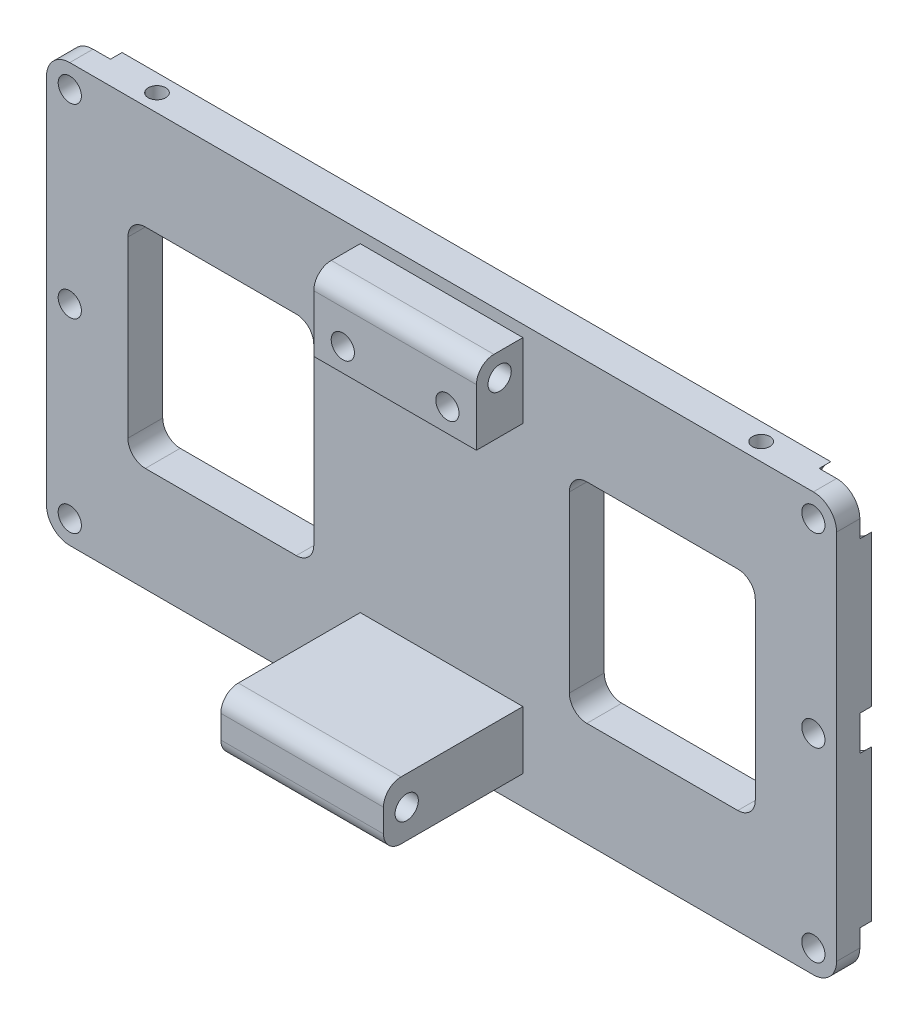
from build123d import *

# Parameters (mm, degrees)
SKETCH2_W               = 215.9
SKETCH2_H               = 114.3
SKETCH2_R               = 3.175
SKETCH2_W_2             = 50.8
SKETCH2_H_2             = 57.15
BOSS_EXTRUDE1_DEPTH     = 9.525
SKETCH4_W               = 44.45
SKETCH4_H               = 20.32
BOSS_EXTRUDE2_DEPTH     = 12.7
SKETCH6_R               = 3.175
CUT_EXTRUDE2_DEPTH      = 45.72
SKETCH7_R               = 3.175
CUT_EXTRUDE3_DEPTH      = 22.86
SKETCH8_W               = 44.45
SKETCH8_H               = 15.875
BOSS_EXTRUDE3_DEPTH     = 38.1
SKETCH9_R               = 3.175
CUT_EXTRUDE4_DEPTH      = 46.355
CUT_EXTRUDE5_DEPTH      = 15.875
CUT_EXTRUDE5_DEPTH_BACK = 12.7
SKETCH10_R              = 3.9624
FILLET1_R               = 6.35
FILLET2_R               = 4.7752
FILLET3_R               = 4.7752
CUT_EXTRUDE6_START      = -6.35
SKETCH11_R              = 7.9375
CUT_EXTRUDE6_DEPTH      = 10.16
FILLET4_R               = 4.7752
SKETCH12_R              = 2.3876
CUT_EXTRUDE7_DEPTH      = 14.224


with BuildPart() as part:
    # Sketch2 → Boss-Extrude1 (new body)
    with BuildSketch(Plane.XY):
        Rectangle(SKETCH2_W, SKETCH2_H)
        with Locations((-101.6, 50.8)):
            Circle(SKETCH2_R, mode=Mode.SUBTRACT)
        with Locations((-101.6, -50.8)):
            Circle(SKETCH2_R, mode=Mode.SUBTRACT)
        with Locations((101.6, -50.8)):
            Circle(SKETCH2_R, mode=Mode.SUBTRACT)
        with Locations((101.6, 50.8)):
            Circle(SKETCH2_R, mode=Mode.SUBTRACT)
        with Locations((101.6, 0)):
            Circle(SKETCH2_R, mode=Mode.SUBTRACT)
        with Locations((-101.6, 0)):
            Circle(SKETCH2_R, mode=Mode.SUBTRACT)
        with Locations((-60.325, 0)):
            Rectangle(SKETCH2_W_2, SKETCH2_H_2, mode=Mode.SUBTRACT)
        with Locations((60.325, 0)):
            Rectangle(SKETCH2_W_2, SKETCH2_H_2, mode=Mode.SUBTRACT)
    extrude(amount=-BOSS_EXTRUDE1_DEPTH)


with BuildPart() as body_2:
    # Sketch4 → Boss-Extrude2 (new body)
    with BuildSketch(Plane.XY):
        with Locations((0, 43.815)):
            Rectangle(SKETCH4_W, SKETCH4_H)
    extrude(amount=BOSS_EXTRUDE2_DEPTH)

    # Sketch6 → Cut-Extrude2 (cut)
    with BuildSketch(Plane.ZY.offset(22.225)):
        with Locations(Location((6.35, 47.625, 0), (0, 0, 270))):
            Circle(SKETCH6_R)
    extrude(amount=-CUT_EXTRUDE2_DEPTH, mode=Mode.SUBTRACT)


with BuildPart() as cut_extrude3_tool:
    # Sketch7 → Cut-Extrude3 (new, symmetric)
    with BuildSketch(Plane.XY):
        with Locations((-14.2875, 40.005)):
            Circle(SKETCH7_R)
        with Locations((14.2875, 40.005)):
            Circle(SKETCH7_R)
    extrude(amount=CUT_EXTRUDE3_DEPTH, both=True)


with BuildPart() as part_1:
    add(part.part)

    # Cut-Extrude3: cut by cut_extrude3_tool
    add(cut_extrude3_tool.part, mode=Mode.SUBTRACT)


with BuildPart() as body_2_1:
    add(body_2.part)

    # Cut-Extrude3: cut by cut_extrude3_tool
    add(cut_extrude3_tool.part, mode=Mode.SUBTRACT)

    # Fillet3
    fillet3_edges = [body_2_1.edges().sort_by_distance(p)[0] for p in [
        (0, 53.975, 12.7),
    ]]
    fillet(fillet3_edges, radius=FILLET3_R)


with BuildPart() as body_3:
    # Sketch8 → Boss-Extrude3 (new body)
    with BuildSketch(Plane.XY):
        with Locations((0, -41.275)):
            Rectangle(SKETCH8_W, SKETCH8_H)
    extrude(amount=BOSS_EXTRUDE3_DEPTH)

    # Sketch9 → Cut-Extrude4 (cut)
    with BuildSketch(Plane.ZY.offset(22.225)):
        with Locations(Location((31.75, -41.275, 0), (0, 0, 270))):
            Circle(SKETCH9_R)
    extrude(amount=-CUT_EXTRUDE4_DEPTH, mode=Mode.SUBTRACT)


with BuildPart() as cut_extrude5_tool:
    # Sketch10 → Cut-Extrude5 (new, two sides: drawn at the far end of the back side and taken through both)
    with BuildSketch(Plane.XY.offset(-CUT_EXTRUDE5_DEPTH_BACK)):
        with Locations((-14.2875, -41.275)):
            Circle(SKETCH10_R)
        with Locations((14.2875, -41.275)):
            Circle(SKETCH10_R)
    extrude(amount=CUT_EXTRUDE5_DEPTH + CUT_EXTRUDE5_DEPTH_BACK)


with BuildPart() as part_2:
    add(part_1.part)

    # Cut-Extrude5: cut by cut_extrude5_tool
    add(cut_extrude5_tool.part, mode=Mode.SUBTRACT)

    # Fillet1
    fillet1_edges = [part_2.edges().sort_by_distance(p)[0] for p in [
        (107.95, 57.15, -4.7625),
        (107.95, -57.15, -4.7625),
        (-107.95, -57.15, -4.7625),
        (-107.95, 57.15, -4.7625),
    ]]
    fillet(fillet1_edges, radius=FILLET1_R)

    # Sketch11 → Cut-Extrude6 (cut)
    with BuildSketch(Plane.XY.offset(CUT_EXTRUDE6_START)):
        with Locations((-101.6, 50.8)):
            Circle(SKETCH11_R)
        with Locations((-101.6, -50.8)):
            Circle(SKETCH11_R)
        with Locations((101.6, -50.8)):
            Circle(SKETCH11_R)
        with Locations((101.6, 50.8)):
            Circle(SKETCH11_R)
        with Locations((101.6, 0)):
            Circle(SKETCH11_R)
        with Locations((-101.6, 0)):
            Circle(SKETCH11_R)
    extrude(amount=-CUT_EXTRUDE6_DEPTH, mode=Mode.SUBTRACT)

    # Fillet4
    fillet4_edges = [part_2.edges().sort_by_distance(p)[0] for p in [
        (-85.725, -28.575, -4.7625),
        (-85.725, 28.575, -4.7625),
        (-34.925, 28.575, -4.7625),
        (-34.925, -28.575, -4.7625),
        (34.925, -28.575, -4.7625),
        (34.925, 28.575, -4.7625),
        (85.725, 28.575, -4.7625),
        (85.725, -28.575, -4.7625),
    ]]
    fillet(fillet4_edges, radius=FILLET4_R)

    # Sketch12 → Cut-Extrude7 (cut)
    with BuildSketch(Plane(origin=(0, 57.15, 0), x_dir=(1, 0, 0), z_dir=(0, 1, 0))):
        with Locations(Location((-82.55, 4.7752, 0), (0, 0, 180))):
            Circle(SKETCH12_R)
        with Locations(Location((82.55, 4.7752, 0), (0, 0, 180))):
            Circle(SKETCH12_R)
    extrude(amount=-CUT_EXTRUDE7_DEPTH, mode=Mode.SUBTRACT)


with BuildPart() as body_3_1:
    add(body_3.part)

    # Cut-Extrude5: cut by cut_extrude5_tool
    add(cut_extrude5_tool.part, mode=Mode.SUBTRACT)

    # Fillet2
    fillet2_edges = [body_3_1.edges().sort_by_distance(p)[0] for p in [
        (0, -33.3375, 38.1),
        (0, -49.2125, 38.1),
    ]]
    fillet(fillet2_edges, radius=FILLET2_R)


solid = Compound([body_2_1.part, part_2.part, body_3_1.part])
